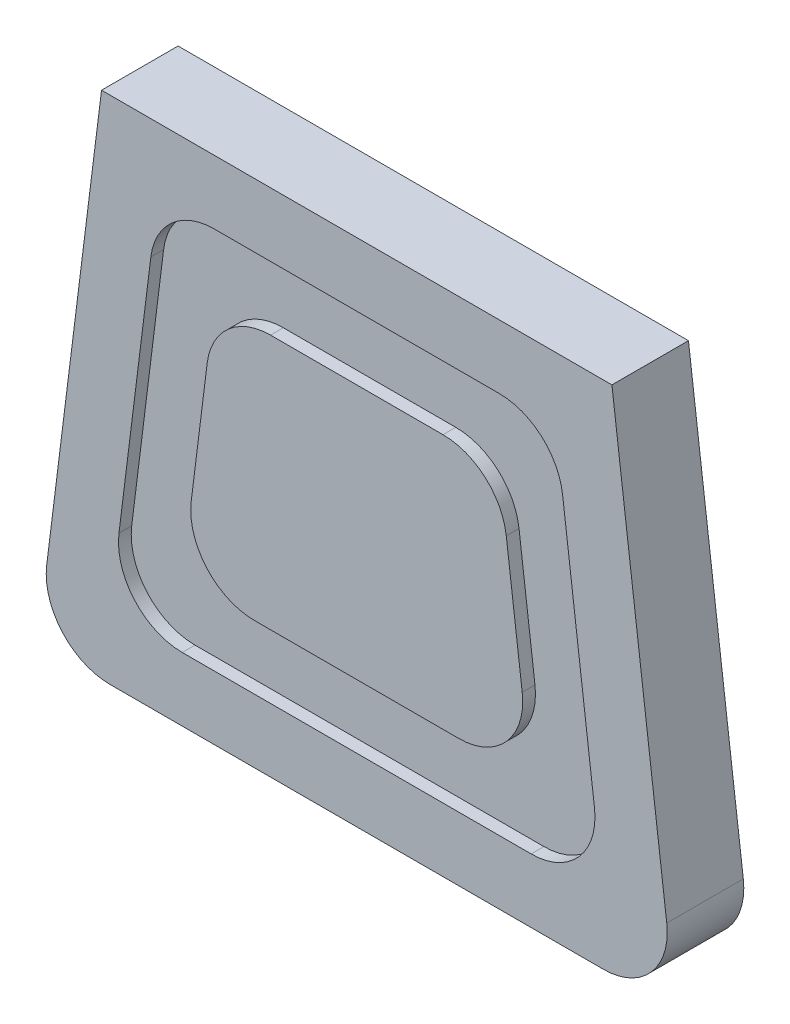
from build123d import *

# Parameters (mm, degrees)
EXTRUSION1_DEPTH        = 6
CONG_1_R                = 5
ENL_V_MAT_EXTRU_1_DEPTH = 1
CONG_2_R                = 5


with BuildPart() as part:
    # Esquisse1 → Extrusion1 (new body)
    with BuildSketch(Plane.XY):
        Polygon((20, 0), (-20, 0), (-25, -40), (25, -40), align=None)
    extrude(amount=EXTRUSION1_DEPTH)

    # Cong_1
    cong_1_edges = [part.edges().sort_by_distance(p)[0] for p in [
        (25, -40, 3),
        (-25, -40, 3),
    ]]
    fillet(cong_1_edges, radius=CONG_1_R)

    # Esquisse2 → Enl_v. mat.-Extru.1 (cut)
    with BuildSketch(Plane.XY.offset(6)):
        Polygon((15.586088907, -5), (-15.586088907, -5), (-19.336088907, -35), (19.336088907, -35), align=None)
        Polygon((11.172177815, -10), (-11.172177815, -10), (-13.672177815, -30), (13.672177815, -30), align=None, mode=Mode.SUBTRACT)
    extrude(amount=-ENL_V_MAT_EXTRU_1_DEPTH, mode=Mode.SUBTRACT)

    # Cong_2
    cong_2_edges = [part.edges().sort_by_distance(p)[0] for p in [
        (-19.336088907, -35, 5.5),
        (-15.586088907, -5, 5.5),
        (15.586088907, -5, 5.5),
        (19.336088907, -35, 5.5),
        (-11.172177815, -10, 5.5),
        (11.172177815, -10, 5.5),
        (13.672177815, -30, 5.5),
        (-13.672177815, -30, 5.5),
    ]]
    fillet(cong_2_edges, radius=CONG_2_R)


solid = part.part
